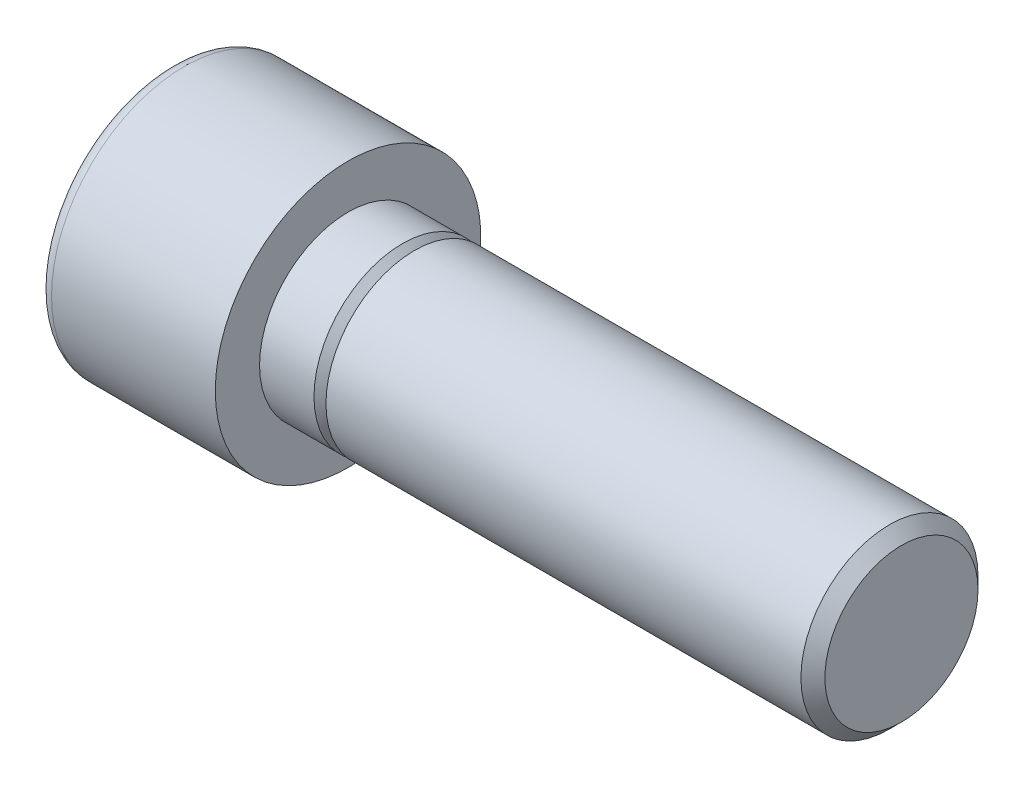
from build123d import *

# Parameters (mm, degrees)
ENL_V_MAT_EXTRU_1_DEPTH = 8
CHANFREIN1_SIZE         = 1.0825
CONG_1_R                = 1.2


with BuildPart() as part:
    # Esquisse1 → R_volution1 (revolve)
    with BuildSketch(Plane(origin=(0, 0, 0), x_dir=(-1, 0, 0), z_dir=(0, 0, -1)), mode=Mode.PRIVATE) as r_volution1_sk:
        Polygon((-80, 8), (-80, 0), (-14, 0), (-14, 12), (-30, 12), (-30, 8), (-34.9175, 8), (-36, 6.9175), (-36, 8), align=None)
    revolve(r_volution1_sk.sketch.rotate(Axis((80, 0, 0), (-1, 0, 0)), 270), axis=Axis((80, 0, 0), (-1, 0, 0)))

    # Esquisse2 → Enl_v. mat.-Extru.1 (cut)
    with BuildSketch(Plane.ZY.offset(-14)):
        Polygon((-7, -4.041451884), (0, -8.082903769), (7, -4.041451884), (7, 4.041451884), (0, 8.082903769), (-7, 4.041451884), align=None)
    extrude(amount=-ENL_V_MAT_EXTRU_1_DEPTH, mode=Mode.SUBTRACT)

    # Chanfrein1
    chanfrein1_edges = [part.edges().sort_by_distance(p)[0] for p in [
        (80, 0, -8),
    ]]
    chamfer(chanfrein1_edges, length=CHANFREIN1_SIZE)

    # Cong_1
    cong_1_edges = [part.edges().sort_by_distance(p)[0] for p in [
        (14, 0, -12),
    ]]
    fillet(cong_1_edges, radius=CONG_1_R)


solid = part.part
